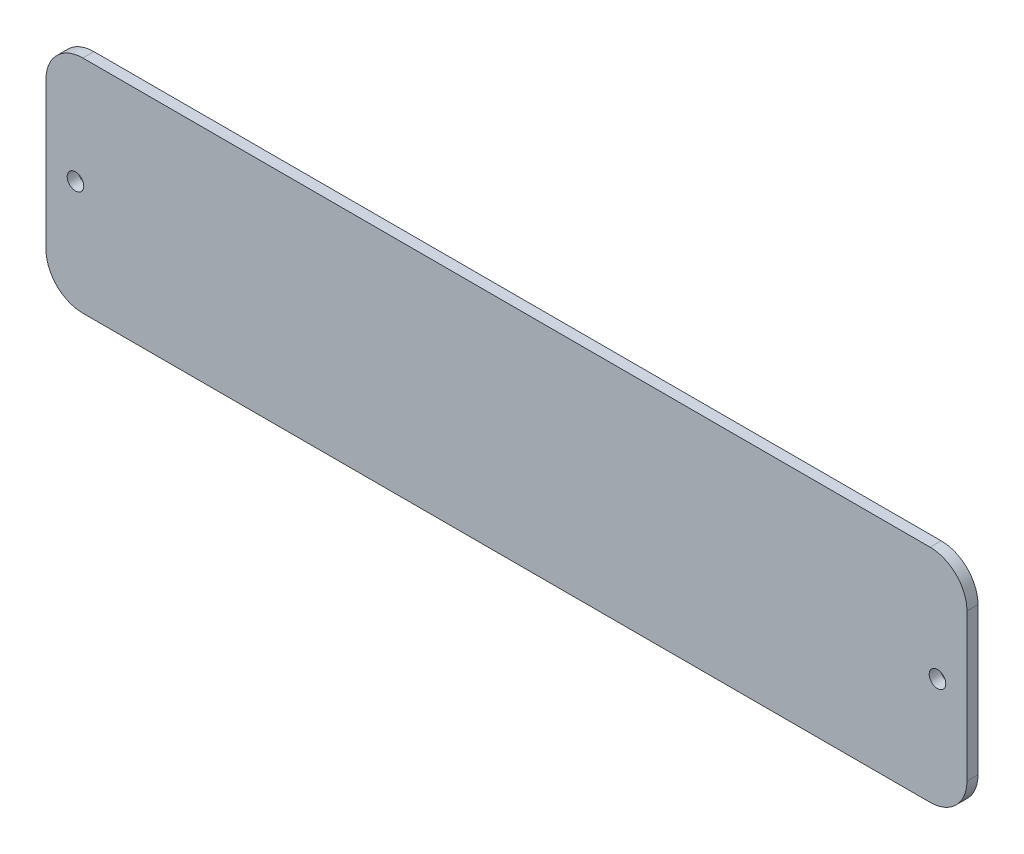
ISO-10303-21;
HEADER;
FILE_DESCRIPTION(('STEP AP214'),'2;1');
FILE_NAME('part.step','',(''),(''),'','','');
FILE_SCHEMA(('AUTOMOTIVE_DESIGN { 1 0 10303 214 1 1 1 1 }'));
ENDSEC;
DATA;
#1=APPLICATION_CONTEXT('core data for automotive mechanical design processes');
#2=APPLICATION_PROTOCOL_DEFINITION('international standard','automotive_design',2000,#1);
#3=PRODUCT_CONTEXT('',#1,'mechanical');
#4=PRODUCT('Part','Part','',(#3));
#5=PRODUCT_RELATED_PRODUCT_CATEGORY('part','',(#4));
#6=PRODUCT_DEFINITION_FORMATION('','',#4);
#7=PRODUCT_DEFINITION_CONTEXT('part definition',#1,'design');
#8=PRODUCT_DEFINITION('design','',#6,#7);
#9=PRODUCT_DEFINITION_SHAPE('','',#8);
#10=(LENGTH_UNIT() NAMED_UNIT(*) SI_UNIT(.MILLI.,.METRE.));
#11=(NAMED_UNIT(*) PLANE_ANGLE_UNIT() SI_UNIT($,.RADIAN.));
#12=(NAMED_UNIT(*) SI_UNIT($,.STERADIAN.) SOLID_ANGLE_UNIT());
#13=UNCERTAINTY_MEASURE_WITH_UNIT(LENGTH_MEASURE(1.E-05),#10,'distance_accuracy_value','');
#14=(GEOMETRIC_REPRESENTATION_CONTEXT(3) GLOBAL_UNCERTAINTY_ASSIGNED_CONTEXT((#13)) GLOBAL_UNIT_ASSIGNED_CONTEXT((#10,
#11,#12)) REPRESENTATION_CONTEXT('',''));
#15=CARTESIAN_POINT('',(0.,0.,0.));
#16=DIRECTION('',(0.,0.,1.));
#17=DIRECTION('',(1.,0.,0.));
#18=AXIS2_PLACEMENT_3D('',#15,#16,#17);
#19=CARTESIAN_POINT('',(20.,-20.,6.));
#20=DIRECTION('',(0.,0.,-1.));
#21=DIRECTION('',(-1.,0.,0.));
#22=AXIS2_PLACEMENT_3D('',#19,#20,#21);
#23=PLANE('',#22);
#24=CARTESIAN_POINT('',(484.,-60.,6.));
#25=DIRECTION('',(0.,0.,1.));
#26=DIRECTION('',(1.,0.,0.));
#27=AXIS2_PLACEMENT_3D('',#24,#25,#26);
#28=CIRCLE('',#27,4.50000000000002);
#29=CARTESIAN_POINT('',(488.5,-60.,6.));
#30=VERTEX_POINT('',#29);
#31=EDGE_CURVE('E112',#30,#30,#28,.T.);
#32=ORIENTED_EDGE('',*,*,#31,.F.);
#33=EDGE_LOOP('',(#32));
#34=FACE_BOUND('',#33,.T.);
#35=CARTESIAN_POINT('',(20.,-20.,6.));
#36=DIRECTION('',(0.,0.,1.));
#37=DIRECTION('',(-1.,0.,0.));
#38=AXIS2_PLACEMENT_3D('',#35,#36,#37);
#39=CIRCLE('',#38,20.);
#40=CARTESIAN_POINT('',(20.0000000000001,0.,6.));
#41=VERTEX_POINT('',#40);
#42=CARTESIAN_POINT('',(0.,-20.0000000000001,6.));
#43=VERTEX_POINT('',#42);
#44=EDGE_CURVE('E130',#41,#43,#39,.T.);
#45=ORIENTED_EDGE('',*,*,#44,.T.);
#46=DIRECTION('',(0.,-1.,0.));
#47=VECTOR('',#46,1.);
#48=CARTESIAN_POINT('',(0.,-20.0000000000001,6.));
#49=LINE('',#48,#47);
#50=CARTESIAN_POINT('',(0.,-99.9999999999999,6.));
#51=VERTEX_POINT('',#50);
#52=EDGE_CURVE('E107',#43,#51,#49,.T.);
#53=ORIENTED_EDGE('',*,*,#52,.T.);
#54=CARTESIAN_POINT('',(20.,-100.,6.));
#55=DIRECTION('',(0.,0.,1.));
#56=DIRECTION('',(-1.,0.,0.));
#57=AXIS2_PLACEMENT_3D('',#54,#55,#56);
#58=CIRCLE('',#57,20.);
#59=CARTESIAN_POINT('',(20.0000000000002,-120.,6.));
#60=VERTEX_POINT('',#59);
#61=EDGE_CURVE('E133',#51,#60,#58,.T.);
#62=ORIENTED_EDGE('',*,*,#61,.T.);
#63=DIRECTION('',(1.,0.,0.));
#64=VECTOR('',#63,1.);
#65=CARTESIAN_POINT('',(20.0000000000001,-120.,6.));
#66=LINE('',#65,#64);
#67=CARTESIAN_POINT('',(480.,-120.,6.));
#68=VERTEX_POINT('',#67);
#69=EDGE_CURVE('E135',#60,#68,#66,.T.);
#70=ORIENTED_EDGE('',*,*,#69,.T.);
#71=CARTESIAN_POINT('',(480.,-100.,6.));
#72=DIRECTION('',(0.,0.,1.));
#73=DIRECTION('',(-1.,0.,0.));
#74=AXIS2_PLACEMENT_3D('',#71,#72,#73);
#75=CIRCLE('',#74,20.);
#76=CARTESIAN_POINT('',(500.,-99.9999999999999,6.));
#77=VERTEX_POINT('',#76);
#78=EDGE_CURVE('E137',#68,#77,#75,.T.);
#79=ORIENTED_EDGE('',*,*,#78,.T.);
#80=DIRECTION('',(0.,1.,0.));
#81=VECTOR('',#80,1.);
#82=CARTESIAN_POINT('',(500.,-20.0000000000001,6.));
#83=LINE('',#82,#81);
#84=CARTESIAN_POINT('',(500.,-20.0000000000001,6.));
#85=VERTEX_POINT('',#84);
#86=EDGE_CURVE('E139',#77,#85,#83,.T.);
#87=ORIENTED_EDGE('',*,*,#86,.T.);
#88=CARTESIAN_POINT('',(480.,-20.,6.));
#89=DIRECTION('',(0.,0.,1.));
#90=DIRECTION('',(1.,0.,0.));
#91=AXIS2_PLACEMENT_3D('',#88,#89,#90);
#92=CIRCLE('',#91,20.);
#93=CARTESIAN_POINT('',(480.,0.,6.));
#94=VERTEX_POINT('',#93);
#95=EDGE_CURVE('E48',#85,#94,#92,.T.);
#96=ORIENTED_EDGE('',*,*,#95,.T.);
#97=DIRECTION('',(-1.,0.,0.));
#98=VECTOR('',#97,1.);
#99=CARTESIAN_POINT('',(20.0000000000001,0.,6.));
#100=LINE('',#99,#98);
#101=EDGE_CURVE('E43',#94,#41,#100,.T.);
#102=ORIENTED_EDGE('',*,*,#101,.T.);
#103=EDGE_LOOP('',(#45,#53,#62,#70,#79,#87,#96,#102));
#104=FACE_BOUND('',#103,.T.);
#105=CARTESIAN_POINT('',(16.,-60.,6.));
#106=DIRECTION('',(0.,0.,1.));
#107=DIRECTION('',(1.,0.,0.));
#108=AXIS2_PLACEMENT_3D('',#105,#106,#107);
#109=CIRCLE('',#108,4.50000000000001);
#110=CARTESIAN_POINT('',(20.5,-60.,6.));
#111=VERTEX_POINT('',#110);
#112=EDGE_CURVE('E210',#111,#111,#109,.T.);
#113=ORIENTED_EDGE('',*,*,#112,.F.);
#114=EDGE_LOOP('',(#113));
#115=FACE_BOUND('',#114,.T.);
#116=ADVANCED_FACE('F28',(#34,#104,#115),#23,.F.);
#117=CARTESIAN_POINT('',(20.,-20.,0.));
#118=DIRECTION('',(0.,0.,-1.));
#119=DIRECTION('',(-1.,0.,0.));
#120=AXIS2_PLACEMENT_3D('',#117,#118,#119);
#121=PLANE('',#120);
#122=CARTESIAN_POINT('',(484.,-60.,0.));
#123=DIRECTION('',(0.,0.,1.));
#124=DIRECTION('',(1.,0.,0.));
#125=AXIS2_PLACEMENT_3D('',#122,#123,#124);
#126=CIRCLE('',#125,4.50000000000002);
#127=CARTESIAN_POINT('',(488.5,-60.,0.));
#128=VERTEX_POINT('',#127);
#129=EDGE_CURVE('E115',#128,#128,#126,.T.);
#130=ORIENTED_EDGE('',*,*,#129,.T.);
#131=EDGE_LOOP('',(#130));
#132=FACE_BOUND('',#131,.T.);
#133=CARTESIAN_POINT('',(20.,-20.,0.));
#134=DIRECTION('',(0.,0.,1.));
#135=DIRECTION('',(-1.,0.,0.));
#136=AXIS2_PLACEMENT_3D('',#133,#134,#135);
#137=CIRCLE('',#136,20.);
#138=CARTESIAN_POINT('',(20.0000000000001,0.,0.));
#139=VERTEX_POINT('',#138);
#140=CARTESIAN_POINT('',(0.,-20.0000000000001,0.));
#141=VERTEX_POINT('',#140);
#142=EDGE_CURVE('E98',#139,#141,#137,.T.);
#143=ORIENTED_EDGE('',*,*,#142,.F.);
#144=DIRECTION('',(-1.,0.,0.));
#145=VECTOR('',#144,1.);
#146=CARTESIAN_POINT('',(20.0000000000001,0.,0.));
#147=LINE('',#146,#145);
#148=CARTESIAN_POINT('',(480.,0.,0.));
#149=VERTEX_POINT('',#148);
#150=EDGE_CURVE('E128',#149,#139,#147,.T.);
#151=ORIENTED_EDGE('',*,*,#150,.F.);
#152=CARTESIAN_POINT('',(480.,-20.,0.));
#153=DIRECTION('',(0.,0.,1.));
#154=DIRECTION('',(1.,0.,0.));
#155=AXIS2_PLACEMENT_3D('',#152,#153,#154);
#156=CIRCLE('',#155,20.);
#157=CARTESIAN_POINT('',(500.,-20.0000000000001,0.));
#158=VERTEX_POINT('',#157);
#159=EDGE_CURVE('E126',#158,#149,#156,.T.);
#160=ORIENTED_EDGE('',*,*,#159,.F.);
#161=DIRECTION('',(0.,1.,0.));
#162=VECTOR('',#161,1.);
#163=CARTESIAN_POINT('',(500.,-20.0000000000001,0.));
#164=LINE('',#163,#162);
#165=CARTESIAN_POINT('',(500.,-99.9999999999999,0.));
#166=VERTEX_POINT('',#165);
#167=EDGE_CURVE('E124',#166,#158,#164,.T.);
#168=ORIENTED_EDGE('',*,*,#167,.F.);
#169=CARTESIAN_POINT('',(480.,-100.,0.));
#170=DIRECTION('',(0.,0.,1.));
#171=DIRECTION('',(-1.,0.,0.));
#172=AXIS2_PLACEMENT_3D('',#169,#170,#171);
#173=CIRCLE('',#172,20.);
#174=CARTESIAN_POINT('',(480.,-120.,0.));
#175=VERTEX_POINT('',#174);
#176=EDGE_CURVE('E122',#175,#166,#173,.T.);
#177=ORIENTED_EDGE('',*,*,#176,.F.);
#178=DIRECTION('',(1.,0.,0.));
#179=VECTOR('',#178,1.);
#180=CARTESIAN_POINT('',(20.0000000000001,-120.,0.));
#181=LINE('',#180,#179);
#182=CARTESIAN_POINT('',(20.0000000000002,-120.,0.));
#183=VERTEX_POINT('',#182);
#184=EDGE_CURVE('E120',#183,#175,#181,.T.);
#185=ORIENTED_EDGE('',*,*,#184,.F.);
#186=CARTESIAN_POINT('',(20.,-100.,0.));
#187=DIRECTION('',(0.,0.,1.));
#188=DIRECTION('',(-1.,0.,0.));
#189=AXIS2_PLACEMENT_3D('',#186,#187,#188);
#190=CIRCLE('',#189,20.);
#191=CARTESIAN_POINT('',(0.,-99.9999999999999,0.));
#192=VERTEX_POINT('',#191);
#193=EDGE_CURVE('E100',#192,#183,#190,.T.);
#194=ORIENTED_EDGE('',*,*,#193,.F.);
#195=DIRECTION('',(0.,-1.,0.));
#196=VECTOR('',#195,1.);
#197=CARTESIAN_POINT('',(0.,-20.0000000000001,0.));
#198=LINE('',#197,#196);
#199=EDGE_CURVE('E93',#141,#192,#198,.T.);
#200=ORIENTED_EDGE('',*,*,#199,.F.);
#201=EDGE_LOOP('',(#143,#151,#160,#168,#177,#185,#194,#200));
#202=FACE_BOUND('',#201,.T.);
#203=CARTESIAN_POINT('',(16.,-60.,0.));
#204=DIRECTION('',(0.,0.,1.));
#205=DIRECTION('',(1.,0.,0.));
#206=AXIS2_PLACEMENT_3D('',#203,#204,#205);
#207=CIRCLE('',#206,4.50000000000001);
#208=CARTESIAN_POINT('',(20.5,-60.,0.));
#209=VERTEX_POINT('',#208);
#210=EDGE_CURVE('E213',#209,#209,#207,.T.);
#211=ORIENTED_EDGE('',*,*,#210,.T.);
#212=EDGE_LOOP('',(#211));
#213=FACE_BOUND('',#212,.T.);
#214=ADVANCED_FACE('F94',(#132,#202,#213),#121,.T.);
#215=CARTESIAN_POINT('',(20.,-20.,6.));
#216=DIRECTION('',(0.,0.,-1.));
#217=DIRECTION('',(-1.,0.,0.));
#218=AXIS2_PLACEMENT_3D('',#215,#216,#217);
#219=CYLINDRICAL_SURFACE('',#218,20.);
#220=ORIENTED_EDGE('',*,*,#142,.T.);
#221=DIRECTION('',(0.,0.,-1.));
#222=VECTOR('',#221,1.);
#223=CARTESIAN_POINT('',(0.,-20.0000000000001,6.));
#224=LINE('',#223,#222);
#225=EDGE_CURVE('E11',#43,#141,#224,.T.);
#226=ORIENTED_EDGE('',*,*,#225,.F.);
#227=ORIENTED_EDGE('',*,*,#44,.F.);
#228=DIRECTION('',(0.,0.,-1.));
#229=VECTOR('',#228,1.);
#230=CARTESIAN_POINT('',(20.0000000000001,0.,6.));
#231=LINE('',#230,#229);
#232=EDGE_CURVE('E111',#41,#139,#231,.T.);
#233=ORIENTED_EDGE('',*,*,#232,.T.);
#234=EDGE_LOOP('',(#220,#226,#227,#233));
#235=FACE_BOUND('',#234,.T.);
#236=ADVANCED_FACE('F30',(#235),#219,.T.);
#237=CARTESIAN_POINT('',(0.,-20.0000000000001,6.));
#238=DIRECTION('',(1.,0.,0.));
#239=DIRECTION('',(0.,1.,0.));
#240=AXIS2_PLACEMENT_3D('',#237,#238,#239);
#241=PLANE('',#240);
#242=ORIENTED_EDGE('',*,*,#199,.T.);
#243=DIRECTION('',(0.,0.,-1.));
#244=VECTOR('',#243,1.);
#245=CARTESIAN_POINT('',(0.,-99.9999999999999,6.));
#246=LINE('',#245,#244);
#247=EDGE_CURVE('E36',#51,#192,#246,.T.);
#248=ORIENTED_EDGE('',*,*,#247,.F.);
#249=ORIENTED_EDGE('',*,*,#52,.F.);
#250=ORIENTED_EDGE('',*,*,#225,.T.);
#251=EDGE_LOOP('',(#242,#248,#249,#250));
#252=FACE_BOUND('',#251,.T.);
#253=ADVANCED_FACE('F106',(#252),#241,.F.);
#254=CARTESIAN_POINT('',(20.,-100.,6.));
#255=DIRECTION('',(0.,0.,-1.));
#256=DIRECTION('',(-1.,0.,0.));
#257=AXIS2_PLACEMENT_3D('',#254,#255,#256);
#258=CYLINDRICAL_SURFACE('',#257,20.);
#259=ORIENTED_EDGE('',*,*,#193,.T.);
#260=DIRECTION('',(0.,0.,-1.));
#261=VECTOR('',#260,1.);
#262=CARTESIAN_POINT('',(20.0000000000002,-120.,6.));
#263=LINE('',#262,#261);
#264=EDGE_CURVE('E156',#60,#183,#263,.T.);
#265=ORIENTED_EDGE('',*,*,#264,.F.);
#266=ORIENTED_EDGE('',*,*,#61,.F.);
#267=ORIENTED_EDGE('',*,*,#247,.T.);
#268=EDGE_LOOP('',(#259,#265,#266,#267));
#269=FACE_BOUND('',#268,.T.);
#270=ADVANCED_FACE('F160',(#269),#258,.T.);
#271=CARTESIAN_POINT('',(20.0000000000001,-120.,6.));
#272=DIRECTION('',(0.,1.,0.));
#273=DIRECTION('',(0.,0.,1.));
#274=AXIS2_PLACEMENT_3D('',#271,#272,#273);
#275=PLANE('',#274);
#276=ORIENTED_EDGE('',*,*,#184,.T.);
#277=DIRECTION('',(0.,0.,-1.));
#278=VECTOR('',#277,1.);
#279=CARTESIAN_POINT('',(480.,-120.,6.));
#280=LINE('',#279,#278);
#281=EDGE_CURVE('E153',#68,#175,#280,.T.);
#282=ORIENTED_EDGE('',*,*,#281,.F.);
#283=ORIENTED_EDGE('',*,*,#69,.F.);
#284=ORIENTED_EDGE('',*,*,#264,.T.);
#285=EDGE_LOOP('',(#276,#282,#283,#284));
#286=FACE_BOUND('',#285,.T.);
#287=ADVANCED_FACE('F168',(#286),#275,.F.);
#288=CARTESIAN_POINT('',(480.,-100.,6.));
#289=DIRECTION('',(0.,0.,-1.));
#290=DIRECTION('',(-1.,0.,0.));
#291=AXIS2_PLACEMENT_3D('',#288,#289,#290);
#292=CYLINDRICAL_SURFACE('',#291,20.);
#293=ORIENTED_EDGE('',*,*,#176,.T.);
#294=DIRECTION('',(0.,0.,-1.));
#295=VECTOR('',#294,1.);
#296=CARTESIAN_POINT('',(500.,-99.9999999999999,6.));
#297=LINE('',#296,#295);
#298=EDGE_CURVE('E150',#77,#166,#297,.T.);
#299=ORIENTED_EDGE('',*,*,#298,.F.);
#300=ORIENTED_EDGE('',*,*,#78,.F.);
#301=ORIENTED_EDGE('',*,*,#281,.T.);
#302=EDGE_LOOP('',(#293,#299,#300,#301));
#303=FACE_BOUND('',#302,.T.);
#304=ADVANCED_FACE('F171',(#303),#292,.T.);
#305=CARTESIAN_POINT('',(500.,-20.0000000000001,6.));
#306=DIRECTION('',(-1.,0.,0.));
#307=DIRECTION('',(0.,0.,1.));
#308=AXIS2_PLACEMENT_3D('',#305,#306,#307);
#309=PLANE('',#308);
#310=ORIENTED_EDGE('',*,*,#167,.T.);
#311=DIRECTION('',(0.,0.,-1.));
#312=VECTOR('',#311,1.);
#313=CARTESIAN_POINT('',(500.,-20.0000000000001,6.));
#314=LINE('',#313,#312);
#315=EDGE_CURVE('E147',#85,#158,#314,.T.);
#316=ORIENTED_EDGE('',*,*,#315,.F.);
#317=ORIENTED_EDGE('',*,*,#86,.F.);
#318=ORIENTED_EDGE('',*,*,#298,.T.);
#319=EDGE_LOOP('',(#310,#316,#317,#318));
#320=FACE_BOUND('',#319,.T.);
#321=ADVANCED_FACE('F176',(#320),#309,.F.);
#322=CARTESIAN_POINT('',(480.,-20.,6.));
#323=DIRECTION('',(0.,0.,-1.));
#324=DIRECTION('',(-1.,0.,0.));
#325=AXIS2_PLACEMENT_3D('',#322,#323,#324);
#326=CYLINDRICAL_SURFACE('',#325,20.);
#327=ORIENTED_EDGE('',*,*,#159,.T.);
#328=DIRECTION('',(0.,0.,-1.));
#329=VECTOR('',#328,1.);
#330=CARTESIAN_POINT('',(480.,0.,6.));
#331=LINE('',#330,#329);
#332=EDGE_CURVE('E144',#94,#149,#331,.T.);
#333=ORIENTED_EDGE('',*,*,#332,.F.);
#334=ORIENTED_EDGE('',*,*,#95,.F.);
#335=ORIENTED_EDGE('',*,*,#315,.T.);
#336=EDGE_LOOP('',(#327,#333,#334,#335));
#337=FACE_BOUND('',#336,.T.);
#338=ADVANCED_FACE('F179',(#337),#326,.T.);
#339=CARTESIAN_POINT('',(20.0000000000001,0.,6.));
#340=DIRECTION('',(0.,-1.,0.));
#341=DIRECTION('',(0.,0.,-1.));
#342=AXIS2_PLACEMENT_3D('',#339,#340,#341);
#343=PLANE('',#342);
#344=ORIENTED_EDGE('',*,*,#150,.T.);
#345=ORIENTED_EDGE('',*,*,#232,.F.);
#346=ORIENTED_EDGE('',*,*,#101,.F.);
#347=ORIENTED_EDGE('',*,*,#332,.T.);
#348=EDGE_LOOP('',(#344,#345,#346,#347));
#349=FACE_BOUND('',#348,.T.);
#350=ADVANCED_FACE('F181',(#349),#343,.F.);
#351=CARTESIAN_POINT('',(484.,-60.,6.));
#352=DIRECTION('',(0.,0.,-1.));
#353=DIRECTION('',(-1.,0.,0.));
#354=AXIS2_PLACEMENT_3D('',#351,#352,#353);
#355=CYLINDRICAL_SURFACE('',#354,4.50000000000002);
#356=ORIENTED_EDGE('',*,*,#31,.T.);
#357=EDGE_LOOP('',(#356));
#358=FACE_BOUND('',#357,.T.);
#359=ORIENTED_EDGE('',*,*,#129,.F.);
#360=EDGE_LOOP('',(#359));
#361=FACE_BOUND('',#360,.T.);
#362=ADVANCED_FACE('F183',(#358,#361),#355,.F.);
#363=CARTESIAN_POINT('',(16.,-60.,6.));
#364=DIRECTION('',(0.,0.,-1.));
#365=DIRECTION('',(-1.,0.,0.));
#366=AXIS2_PLACEMENT_3D('',#363,#364,#365);
#367=CYLINDRICAL_SURFACE('',#366,4.50000000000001);
#368=ORIENTED_EDGE('',*,*,#112,.T.);
#369=EDGE_LOOP('',(#368));
#370=FACE_BOUND('',#369,.T.);
#371=ORIENTED_EDGE('',*,*,#210,.F.);
#372=EDGE_LOOP('',(#371));
#373=FACE_BOUND('',#372,.T.);
#374=ADVANCED_FACE('F189',(#370,#373),#367,.F.);
#375=CLOSED_SHELL('',(#116,#214,#236,#253,#270,#287,#304,#321,#338,#350,#362,#374));
#376=MANIFOLD_SOLID_BREP('B2',#375);
#377=ADVANCED_BREP_SHAPE_REPRESENTATION('',(#18,#376),#14);
#378=SHAPE_DEFINITION_REPRESENTATION(#9,#377);
ENDSEC;
END-ISO-10303-21;
